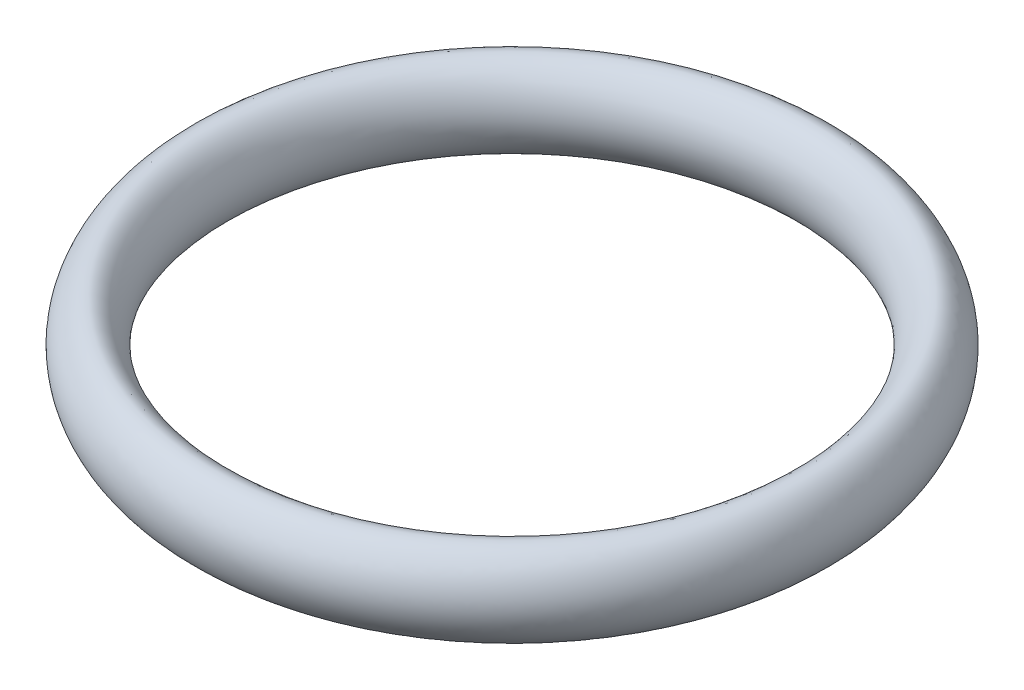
ISO-10303-21;
HEADER;
FILE_DESCRIPTION(('STEP AP214'),'2;1');
FILE_NAME('part.step','',(''),(''),'','','');
FILE_SCHEMA(('AUTOMOTIVE_DESIGN { 1 0 10303 214 1 1 1 1 }'));
ENDSEC;
DATA;
#1=APPLICATION_CONTEXT('core data for automotive mechanical design processes');
#2=APPLICATION_PROTOCOL_DEFINITION('international standard','automotive_design',2000,#1);
#3=PRODUCT_CONTEXT('',#1,'mechanical');
#4=PRODUCT('Part','Part','',(#3));
#5=PRODUCT_RELATED_PRODUCT_CATEGORY('part','',(#4));
#6=PRODUCT_DEFINITION_FORMATION('','',#4);
#7=PRODUCT_DEFINITION_CONTEXT('part definition',#1,'design');
#8=PRODUCT_DEFINITION('design','',#6,#7);
#9=PRODUCT_DEFINITION_SHAPE('','',#8);
#10=(LENGTH_UNIT() NAMED_UNIT(*) SI_UNIT(.MILLI.,.METRE.));
#11=(NAMED_UNIT(*) PLANE_ANGLE_UNIT() SI_UNIT($,.RADIAN.));
#12=(NAMED_UNIT(*) SI_UNIT($,.STERADIAN.) SOLID_ANGLE_UNIT());
#13=UNCERTAINTY_MEASURE_WITH_UNIT(LENGTH_MEASURE(1.E-05),#10,'distance_accuracy_value','');
#14=(GEOMETRIC_REPRESENTATION_CONTEXT(3) GLOBAL_UNCERTAINTY_ASSIGNED_CONTEXT((#13)) GLOBAL_UNIT_ASSIGNED_CONTEXT((#10,
#11,#12)) REPRESENTATION_CONTEXT('',''));
#15=CARTESIAN_POINT('',(0.,0.,0.));
#16=DIRECTION('',(0.,0.,1.));
#17=DIRECTION('',(1.,0.,0.));
#18=AXIS2_PLACEMENT_3D('',#15,#16,#17);
#19=CARTESIAN_POINT('',(-23.305,3.28499999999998,0.));
#20=CARTESIAN_POINT('',(-24.4575,3.28499999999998,0.));
#21=CARTESIAN_POINT('',(-26.7625,0.,0.));
#22=CARTESIAN_POINT('',(-23.305,-4.92749999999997,0.));
#23=CARTESIAN_POINT('',(-19.8475,0.,0.));
#24=CARTESIAN_POINT('',(-22.1525,3.28499999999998,0.));
#25=CARTESIAN_POINT('',(-23.305,3.28499999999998,0.));
#26=B_SPLINE_CURVE_WITH_KNOTS('',3,(#19,#20,#21,#22,#23,#24,#25),.UNSPECIFIED.,.T.,.F.,(4,1,1,1,
4),(0.,0.25,0.5,0.75,1.),.UNSPECIFIED.);
#27=CARTESIAN_POINT('',(0.,0.,0.));
#28=DIRECTION('',(0.,-1.,0.));
#29=AXIS1_PLACEMENT('',#27,#28);
#30=SURFACE_OF_REVOLUTION('',#26,#29);
#31=ADVANCED_FACE('F28',(),#30,.T.);
#32=CLOSED_SHELL('',(#31));
#33=MANIFOLD_SOLID_BREP('B2',#32);
#34=ADVANCED_BREP_SHAPE_REPRESENTATION('',(#18,#33),#14);
#35=SHAPE_DEFINITION_REPRESENTATION(#9,#34);
ENDSEC;
END-ISO-10303-21;
